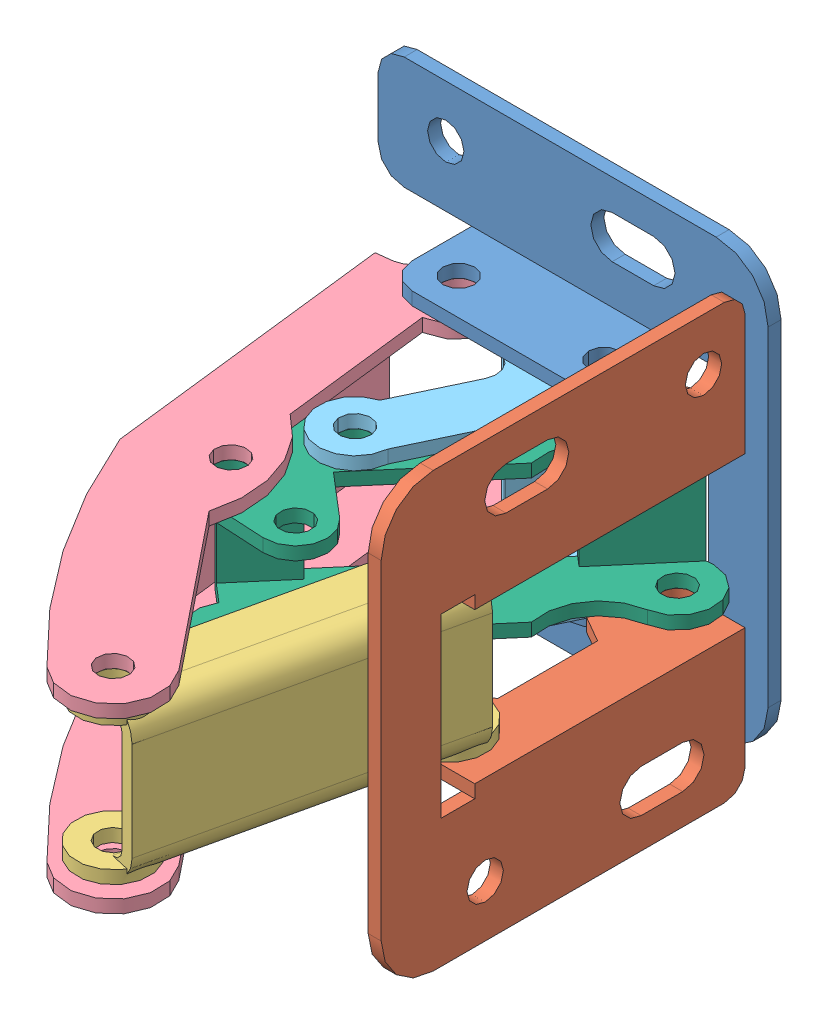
SolidWorks assembly 21.1187 SWING OUT HINGE CLOSED.SLDASM, configuration Default (file format 3800). Lengths in mm.
Overall size (44.48 41.95 60.32).
6 component instances, 6 part files, 12 mates.
Components (placement in the parent):
- 21.1187 SWING OUT HINGE MOUNTING PLATE 1-1: 21.1187 SWING OUT HINGE MOUNTING PLATE 1.SLDPRT [Default] at origin size (37.5 41.7 9.5)
- 21.1187 SWING OUT HINGE MOUNTING PLATE 2-1: 21.1187 SWING OUT HINGE MOUNTING PLATE 2.SLDPRT [Default] at (38.5799 0.25 4.5379) x (0 0 1) z (-1 0 0) size (37 41.7 8.5)
- 21.1187 CONNECTING LINK 1-1: 21.1187 CONNECTING LINK 1.SLDPRT [Default] at (30.8617 0.25 26.0116) x (0 -1 0) z (-0.220343 0 0.975423) size (14.5 7.5 34)
- 21.1187 CONNECTING LINK LONG-1: 21.1187 CONNECTING LINK LONG.SLDPRT [Default] at (12.5 0 6) x (-0.116817 0 -0.993153) z (0 1 0) size (57.76 20.69 17.5)
- 21.1187 CONNCTING LINK INNER SHORTER-1: 21.1187 CONNCTING LINK INNER SHORTER.SLDPRT [Default] at (26.5 0 6) x (0.428317 0 -0.903629) z (0 1 0) size (26 8.22 17.5)
- 21.1187 CONNECTING LINK INNER LONGER-1: 21.1187 CONNECTING LINK INNER LONGER.SLDPRT [Default] at (33.0799 -7 5.5379) x (-0.649528 0 0.760338) z (0 1 0) size (37.7 16 14.5)
Mates (geometry in assembly coordinates):
- Coincident1: coincident aligned: axis of 21.1187 CONNECTING LINK 1-1; axis of 21.1187 SWING OUT HINGE MOUNTING PLATE 2-1
- Coincident2: coincident anti-aligned: axis of 21.1187 SWING OUT HINGE MOUNTING PLATE 1-1; axis of 21.1187 CONNECTING LINK LONG-1
- Coincident3: coincident aligned: axis of 21.1187 CONNECTING LINK 1-1; axis of 21.1187 CONNECTING LINK LONG-1
- Coincident5: coincident anti-aligned: plane of 21.1187 SWING OUT HINGE MOUNTING PLATE 2-1 through (38.5799 7.5 30.5379) normal (0 -1 0); plane of 21.1187 CONNECTING LINK 1-1 through (30.8617 7.5 26.0116) normal (0 1 0)
- Coincident6: coincident anti-aligned: plane of 21.1187 SWING OUT HINGE MOUNTING PLATE 1-1 through (29 8.75 1) normal (0 -1 0); plane of 21.1187 CONNECTING LINK LONG-1 through (15.9106 8.75 30.611) normal (0 1 0)
- Coincident7: coincident aligned: axis of 21.1187 CONNCTING LINK INNER SHORTER-1; axis of 21.1187 SWING OUT HINGE MOUNTING PLATE 1-1
- Coincident8: coincident anti-aligned: plane of 21.1187 SWING OUT HINGE MOUNTING PLATE 1-1 through (19 -8.75 4.5504) normal (0 1 0); plane of 21.1187 CONNCTING LINK INNER SHORTER-1 through (22.8364 -8.75 13.2162) normal (0 -1 0)
- Coincident9: coincident anti-aligned: axis of 21.1187 SWING OUT HINGE MOUNTING PLATE 2-1; axis of 21.1187 CONNECTING LINK INNER LONGER-1
- Coincident10: coincident anti-aligned: plane of 21.1187 SWING OUT HINGE MOUNTING PLATE 2-1 through (34.6295 -7 16.9829) normal (0 1 0); plane of 21.1187 CONNECTING LINK INNER LONGER-1 through (23.1272 -7 19.153) normal (0 -1 0)
- Coincident11: coincident anti-aligned: plane of 21.1187 CONNECTING LINK 1-1 through (30.8617 7.5 26.0116) normal (0 1 0); plane of 21.1187 CONNECTING LINK LONG-1 through (15.2811 7.5 81.0065) normal (0 -1 0)
- Coincident12: coincident aligned: axis of 21.1187 CONNCTING LINK INNER SHORTER-1; axis of 21.1187 CONNECTING LINK INNER LONGER-1
- Coincident13: coincident aligned: axis of 21.1187 CONNECTING LINK LONG-1; axis of 21.1187 CONNECTING LINK INNER LONGER-1
